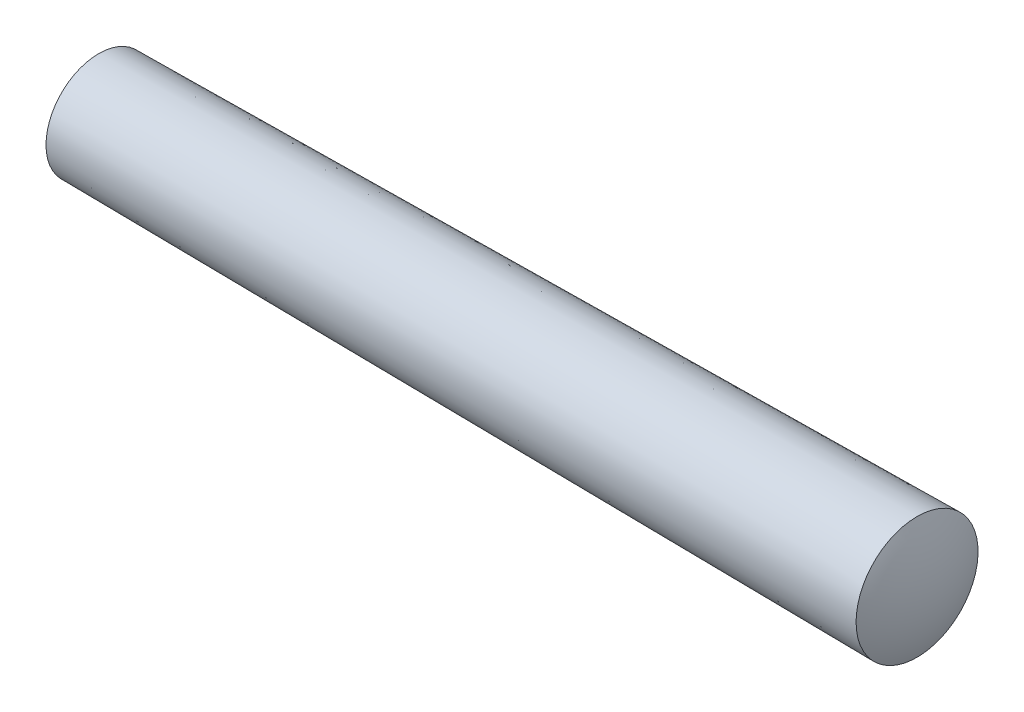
from build123d import *


with BuildPart() as part:
    # BodySke → Body (revolve)
    with BuildSketch(Plane.XY):
        with BuildLine():
            Line((0.63, 2.5), (39.37, 2.8874))
            ThreePointArc((39.37, 2.8874), (39.840668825, 1.477665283), (40, 0))
            Line((40, 0), (0, 0))
            ThreePointArc((0, 0), (0.159924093, 1.289079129), (0.63, 2.5))
        make_face()
    revolve(axis=Axis((0, 0, 0), (1, 0, 0)))


solid = part.part
